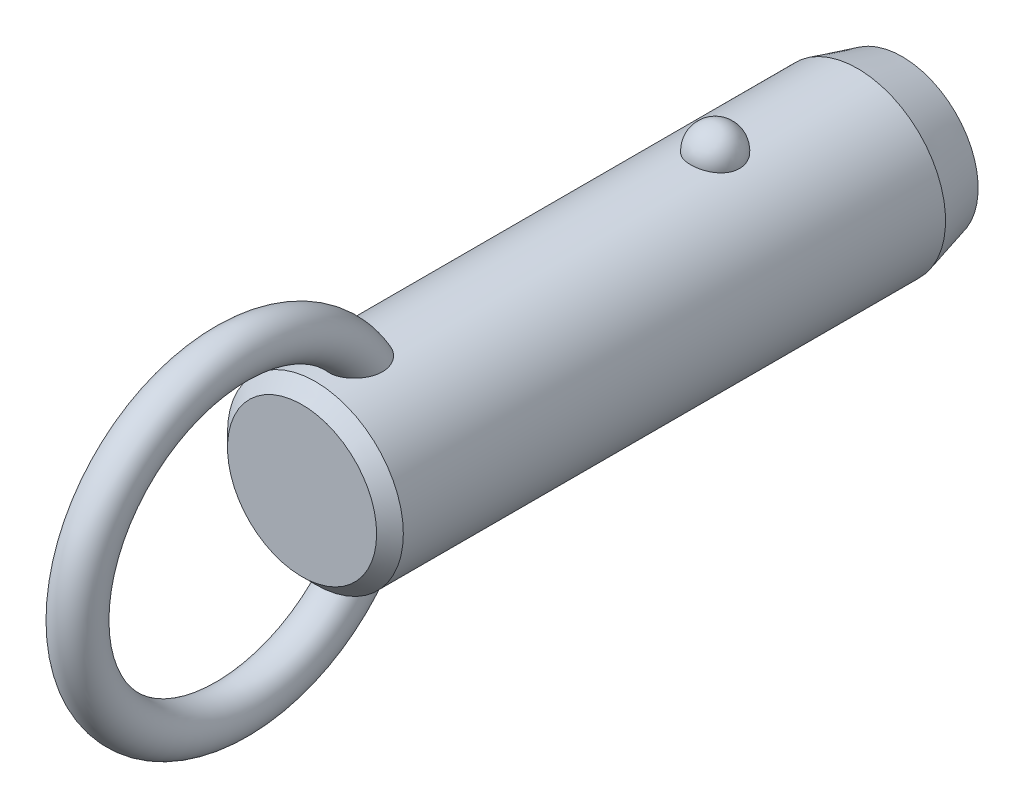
ISO-10303-21;
HEADER;
FILE_DESCRIPTION(('STEP AP214'),'2;1');
FILE_NAME('part.step','',(''),(''),'','','');
FILE_SCHEMA(('AUTOMOTIVE_DESIGN { 1 0 10303 214 1 1 1 1 }'));
ENDSEC;
DATA;
#1=APPLICATION_CONTEXT('core data for automotive mechanical design processes');
#2=APPLICATION_PROTOCOL_DEFINITION('international standard','automotive_design',2000,#1);
#3=PRODUCT_CONTEXT('',#1,'mechanical');
#4=PRODUCT('Part','Part','',(#3));
#5=PRODUCT_RELATED_PRODUCT_CATEGORY('part','',(#4));
#6=PRODUCT_DEFINITION_FORMATION('','',#4);
#7=PRODUCT_DEFINITION_CONTEXT('part definition',#1,'design');
#8=PRODUCT_DEFINITION('design','',#6,#7);
#9=PRODUCT_DEFINITION_SHAPE('','',#8);
#10=(LENGTH_UNIT() NAMED_UNIT(*) SI_UNIT(.MILLI.,.METRE.));
#11=(NAMED_UNIT(*) PLANE_ANGLE_UNIT() SI_UNIT($,.RADIAN.));
#12=(NAMED_UNIT(*) SI_UNIT($,.STERADIAN.) SOLID_ANGLE_UNIT());
#13=UNCERTAINTY_MEASURE_WITH_UNIT(LENGTH_MEASURE(1.E-05),#10,'distance_accuracy_value','');
#14=(GEOMETRIC_REPRESENTATION_CONTEXT(3) GLOBAL_UNCERTAINTY_ASSIGNED_CONTEXT((#13)) GLOBAL_UNIT_ASSIGNED_CONTEXT((#10,
#11,#12)) REPRESENTATION_CONTEXT('',''));
#15=CARTESIAN_POINT('',(0.,0.,0.));
#16=DIRECTION('',(0.,0.,1.));
#17=DIRECTION('',(1.,0.,0.));
#18=AXIS2_PLACEMENT_3D('',#15,#16,#17);
#19=CARTESIAN_POINT('',(0.,0.,25.4));
#20=DIRECTION('',(0.,0.,-1.));
#21=DIRECTION('',(-1.,0.,0.));
#22=AXIS2_PLACEMENT_3D('',#19,#20,#21);
#23=CYLINDRICAL_SURFACE('',#22,7.9);
#24=CARTESIAN_POINT('',(2.1785689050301,7.59367088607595,-2.20000000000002));
#25=CARTESIAN_POINT('',(2.17856679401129,7.59367269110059,-2.07701843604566));
#26=CARTESIAN_POINT('',(2.16853481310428,7.59657145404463,-1.95401006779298));
#27=CARTESIAN_POINT('',(2.12864689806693,7.607843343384,-1.71147811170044));
#28=CARTESIAN_POINT('',(2.09878338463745,7.61621856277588,-1.5919558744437));
#29=CARTESIAN_POINT('',(2.0199931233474,7.63749180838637,-1.35985638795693));
#30=CARTESIAN_POINT('',(1.97107475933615,7.6503878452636,-1.24727610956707));
#31=CARTESIAN_POINT('',(1.85539377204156,7.67926115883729,-1.03213234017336));
#32=CARTESIAN_POINT('',(1.78863158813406,7.69523835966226,-0.929568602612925));
#33=CARTESIAN_POINT('',(1.63856494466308,7.7285848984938,-0.73678633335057));
#34=CARTESIAN_POINT('',(1.55518140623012,7.7459606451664,-0.646630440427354));
#35=CARTESIAN_POINT('',(1.37422937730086,7.78009978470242,-0.481747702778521));
#36=CARTESIAN_POINT('',(1.27666086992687,7.79686317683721,-0.407020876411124));
#37=CARTESIAN_POINT('',(1.07024728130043,7.82786153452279,-0.275278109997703));
#38=CARTESIAN_POINT('',(0.961434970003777,7.84210353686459,-0.218212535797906));
#39=CARTESIAN_POINT('',(0.735351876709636,7.86652194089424,-0.123146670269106));
#40=CARTESIAN_POINT('',(0.618082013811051,7.87669878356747,-0.0851443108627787));
#41=CARTESIAN_POINT('',(0.380637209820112,7.89170521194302,-0.0298158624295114));
#42=CARTESIAN_POINT('',(0.260550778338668,7.89662650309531,-0.0121347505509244));
#43=CARTESIAN_POINT('',(0.0190117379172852,7.90090003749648,0.00324379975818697));
#44=CARTESIAN_POINT('',(-0.102440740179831,7.90025280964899,0.000943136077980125));
#45=CARTESIAN_POINT('',(-0.341452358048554,7.89351056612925,-0.0233955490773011));
#46=CARTESIAN_POINT('',(-0.459042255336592,7.88749257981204,-0.0451545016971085));
#47=CARTESIAN_POINT('',(-0.688796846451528,7.87075812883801,-0.107408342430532));
#48=CARTESIAN_POINT('',(-0.800961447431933,7.86004158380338,-0.14790355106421));
#49=CARTESIAN_POINT('',(-1.01743634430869,7.83497131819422,-0.246799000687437));
#50=CARTESIAN_POINT('',(-1.12169791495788,7.82059709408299,-0.305300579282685));
#51=CARTESIAN_POINT('',(-1.31891765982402,7.78976470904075,-0.43854939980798));
#52=CARTESIAN_POINT('',(-1.41187469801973,7.77330633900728,-0.513298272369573));
#53=CARTESIAN_POINT('',(-1.58577142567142,7.73972434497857,-0.678622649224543));
#54=CARTESIAN_POINT('',(-1.66645140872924,7.72259402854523,-0.769470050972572));
#55=CARTESIAN_POINT('',(-1.81161503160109,7.68983776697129,-0.963538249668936));
#56=CARTESIAN_POINT('',(-1.87609753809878,7.6742119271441,-1.0667599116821));
#57=CARTESIAN_POINT('',(-1.98790138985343,7.6460202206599,-1.28401170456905));
#58=CARTESIAN_POINT('',(-2.03501994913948,7.63349104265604,-1.39815107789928));
#59=CARTESIAN_POINT('',(-2.10986724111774,7.6131449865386,-1.6330178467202));
#60=CARTESIAN_POINT('',(-2.1375965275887,7.60532797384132,-1.75374505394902));
#61=CARTESIAN_POINT('',(-2.17289256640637,7.5953195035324,-1.99782562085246));
#62=CARTESIAN_POINT('',(-2.18054294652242,7.59310471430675,-2.12116592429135));
#63=CARTESIAN_POINT('',(-2.17572919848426,7.59448538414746,-2.36741799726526));
#64=CARTESIAN_POINT('',(-2.1632656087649,7.59808068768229,-2.49032977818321));
#65=CARTESIAN_POINT('',(-2.11865035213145,7.61064035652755,-2.73161015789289));
#66=CARTESIAN_POINT('',(-2.08659579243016,7.61957823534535,-2.84999812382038));
#67=CARTESIAN_POINT('',(-2.00367799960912,7.64179982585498,-3.07955956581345));
#68=CARTESIAN_POINT('',(-1.9528140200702,7.65508371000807,-3.19073275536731));
#69=CARTESIAN_POINT('',(-1.83321113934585,7.68460381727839,-3.40337899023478));
#70=CARTESIAN_POINT('',(-1.76437735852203,7.70085556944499,-3.5047965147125));
#71=CARTESIAN_POINT('',(-1.61069526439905,7.73445734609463,-3.69446912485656));
#72=CARTESIAN_POINT('',(-1.52584634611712,7.75180741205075,-3.78272371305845));
#73=CARTESIAN_POINT('',(-1.34198059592,7.78574608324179,-3.94393987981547));
#74=CARTESIAN_POINT('',(-1.24291308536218,7.80233167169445,-4.01684434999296));
#75=CARTESIAN_POINT('',(-1.03352039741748,7.83281625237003,-4.14489386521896));
#76=CARTESIAN_POINT('',(-0.92319600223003,7.84671543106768,-4.20004014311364));
#77=CARTESIAN_POINT('',(-0.695822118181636,7.87011575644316,-4.29042017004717));
#78=CARTESIAN_POINT('',(-0.578872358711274,7.87966903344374,-4.32589112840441));
#79=CARTESIAN_POINT('',(-0.340410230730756,7.8935652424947,-4.37692226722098));
#80=CARTESIAN_POINT('',(-0.218898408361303,7.89790879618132,-4.39248482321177));
#81=CARTESIAN_POINT('',(0.0228107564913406,7.90087453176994,-4.40314405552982));
#82=CARTESIAN_POINT('',(0.142990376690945,7.89960185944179,-4.39861683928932));
#83=CARTESIAN_POINT('',(0.380829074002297,7.89171262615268,-4.37008293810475));
#84=CARTESIAN_POINT('',(0.498488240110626,7.8850962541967,-4.34607694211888));
#85=CARTESIAN_POINT('',(0.727535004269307,7.86726442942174,-4.27939317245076));
#86=CARTESIAN_POINT('',(0.838944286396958,7.85606616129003,-4.23678512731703));
#87=CARTESIAN_POINT('',(1.05295421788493,7.83025654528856,-4.13408348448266));
#88=CARTESIAN_POINT('',(1.15555431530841,7.81564498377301,-4.07398879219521));
#89=CARTESIAN_POINT('',(1.35076763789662,7.7843022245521,-3.93687432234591));
#90=CARTESIAN_POINT('',(1.4432046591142,7.76754209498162,-3.85961036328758));
#91=CARTESIAN_POINT('',(1.6139111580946,7.73387857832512,-3.69076949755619));
#92=CARTESIAN_POINT('',(1.6921781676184,7.71697516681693,-3.59919010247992));
#93=CARTESIAN_POINT('',(1.83380875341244,7.6845643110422,-3.40247278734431));
#94=CARTESIAN_POINT('',(1.89689280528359,7.66908588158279,-3.29712873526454));
#95=CARTESIAN_POINT('',(2.0047823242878,7.64159441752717,-3.07707931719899));
#96=CARTESIAN_POINT('',(2.0495945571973,7.62958010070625,-2.96237743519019));
#97=CARTESIAN_POINT('',(2.11580183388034,7.61146617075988,-2.74040519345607));
#98=CARTESIAN_POINT('',(2.13929812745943,7.60484503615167,-2.63379846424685));
#99=CARTESIAN_POINT('',(2.17068242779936,7.59594664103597,-2.4181348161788));
#100=CARTESIAN_POINT('',(2.17857077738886,7.59366928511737,-2.30907795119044));
#101=CARTESIAN_POINT('',(2.1785689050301,7.59367088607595,-2.20000000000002));
#102=B_SPLINE_CURVE_WITH_KNOTS('',3,(#24,#25,#26,#27,#28,#29,#30,#31,#32,#33,#34,#35,#36,#37,
#38,#39,#40,#41,#42,#43,#44,#45,#46,#47,#48,#49,#50,#51,#52,#53,#54,#55,#56,#57,#58,#59,#60,#61,
#62,#63,#64,#65,#66,#67,#68,#69,#70,#71,#72,#73,#74,#75,#76,#77,#78,#79,#80,#81,#82,#83,#84,#85,
#86,#87,#88,#89,#90,#91,#92,#93,#94,#95,#96,#97,#98,#99,#100,#101),.UNSPECIFIED.,.T.,.F.,(4,2,2,
2,2,2,2,2,2,2,2,2,2,2,2,2,2,2,2,2,2,2,2,2,2,2,2,2,2,2,2,2,2,2,2,2,2,2,4),(0.,0.368552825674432,
0.737246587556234,1.10577831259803,1.4743009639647,1.8446206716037,2.21494081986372,
2.5842105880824,2.95344028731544,3.31611630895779,3.67875788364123,4.03628044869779,
4.39380913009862,4.75338791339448,5.11300280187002,5.47939989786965,5.8458226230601,
6.21639834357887,6.58696347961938,6.95598276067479,7.32499216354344,7.69218715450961,
8.0593967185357,8.42858578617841,8.79778880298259,9.16834203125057,9.5388695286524,
9.90482699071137,10.2707407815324,10.6298333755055,10.9889132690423,11.3466585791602,
11.7044262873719,12.0676511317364,12.4309391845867,12.8004764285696,13.1698767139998,
13.4967701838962,13.8236564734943),.UNSPECIFIED.);
#103=CARTESIAN_POINT('',(2.1785689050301,7.59367088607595,-2.20000000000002));
#104=VERTEX_POINT('',#103);
#105=EDGE_CURVE('E41',#104,#104,#102,.T.);
#106=ORIENTED_EDGE('',*,*,#105,.T.);
#107=EDGE_LOOP('',(#106));
#108=FACE_BOUND('',#107,.T.);
#109=CARTESIAN_POINT('',(0.,0.,33.72));
#110=DIRECTION('',(0.,0.,1.));
#111=DIRECTION('',(1.,0.,0.));
#112=AXIS2_PLACEMENT_3D('',#109,#110,#111);
#113=CIRCLE('',#112,7.9);
#114=CARTESIAN_POINT('',(7.9,0.,33.72));
#115=VERTEX_POINT('',#114);
#116=EDGE_CURVE('E10',#115,#115,#113,.F.);
#117=ORIENTED_EDGE('',*,*,#116,.T.);
#118=EDGE_LOOP('',(#117));
#119=FACE_BOUND('',#118,.T.);
#120=CARTESIAN_POINT('',(-0.630969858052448,-7.87476203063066,27.6124322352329));
#121=CARTESIAN_POINT('',(-0.734180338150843,-7.8664899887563,27.6472854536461));
#122=CARTESIAN_POINT('',(-0.834476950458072,-7.85639291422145,27.6908160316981));
#123=CARTESIAN_POINT('',(-1.0262035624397,-7.83366343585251,27.7940948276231));
#124=CARTESIAN_POINT('',(-1.1176141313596,-7.82102565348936,27.8538775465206));
#125=CARTESIAN_POINT('',(-1.28877277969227,-7.79464922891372,27.9878390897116));
#126=CARTESIAN_POINT('',(-1.36854014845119,-7.78091246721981,28.061993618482));
#127=CARTESIAN_POINT('',(-1.51461521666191,-7.75380398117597,28.2224941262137));
#128=CARTESIAN_POINT('',(-1.58092966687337,-7.74043207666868,28.3088339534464));
#129=CARTESIAN_POINT('',(-1.70019064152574,-7.71512522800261,28.4929784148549));
#130=CARTESIAN_POINT('',(-1.75284037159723,-7.70322473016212,28.5909792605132));
#131=CARTESIAN_POINT('',(-1.84263464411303,-7.68224112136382,28.7941029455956));
#132=CARTESIAN_POINT('',(-1.87977299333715,-7.6731591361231,28.8992286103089));
#133=CARTESIAN_POINT('',(-1.94152728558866,-7.65777930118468,29.1232849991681));
#134=CARTESIAN_POINT('',(-1.96475471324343,-7.65179654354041,29.2426167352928));
#135=CARTESIAN_POINT('',(-1.99449499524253,-7.64409642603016,29.4834298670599));
#136=CARTESIAN_POINT('',(-2.0010005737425,-7.64238092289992,29.6049121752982));
#137=CARTESIAN_POINT('',(-1.99856014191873,-7.64302120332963,29.8683409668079));
#138=CARTESIAN_POINT('',(-1.98680021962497,-7.64611845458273,30.0102565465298));
#139=CARTESIAN_POINT('',(-1.94457772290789,-7.65696186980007,30.2911188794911));
#140=CARTESIAN_POINT('',(-1.91409393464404,-7.66471330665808,30.4300620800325));
#141=CARTESIAN_POINT('',(-1.82768670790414,-7.68582947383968,30.7319397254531));
#142=CARTESIAN_POINT('',(-1.76772963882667,-7.70003779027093,30.893686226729));
#143=CARTESIAN_POINT('',(-1.65998501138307,-7.72371550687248,31.1276956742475));
#144=CARTESIAN_POINT('',(-1.62107967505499,-7.73200670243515,31.2042974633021));
#145=CARTESIAN_POINT('',(-1.53727726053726,-7.7491037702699,31.3540798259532));
#146=CARTESIAN_POINT('',(-1.4923821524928,-7.75790947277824,31.4272615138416));
#147=CARTESIAN_POINT('',(-1.37397050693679,-7.77993338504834,31.6028838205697));
#148=CARTESIAN_POINT('',(-1.29690364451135,-7.79328473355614,31.7029557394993));
#149=CARTESIAN_POINT('',(-1.12885487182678,-7.81939266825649,31.8907147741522));
#150=CARTESIAN_POINT('',(-1.03789926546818,-7.83215032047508,31.9784247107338));
#151=CARTESIAN_POINT('',(-0.869532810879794,-7.85231710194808,32.1134148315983));
#152=CARTESIAN_POINT('',(-0.795716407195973,-7.86021093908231,32.165076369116));
#153=CARTESIAN_POINT('',(-0.640813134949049,-7.87434920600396,32.2563815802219));
#154=CARTESIAN_POINT('',(-0.55973779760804,-7.88059619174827,32.2960438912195));
#155=CARTESIAN_POINT('',(-0.40645605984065,-7.88984116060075,32.3543008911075));
#156=CARTESIAN_POINT('',(-0.335227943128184,-7.89321892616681,32.3753848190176));
#157=CARTESIAN_POINT('',(-0.190193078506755,-7.89804235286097,32.4054141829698));
#158=CARTESIAN_POINT('',(-0.116388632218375,-7.89948969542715,32.4143701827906));
#159=CARTESIAN_POINT('',(0.0318414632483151,-7.90028409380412,32.4192915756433));
#160=CARTESIAN_POINT('',(0.106268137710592,-7.89962640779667,32.4152276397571));
#161=CARTESIAN_POINT('',(0.253290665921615,-7.8962818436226,32.3944615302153));
#162=CARTESIAN_POINT('',(0.325885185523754,-7.8935935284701,32.3777504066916));
#163=CARTESIAN_POINT('',(0.481441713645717,-7.88577340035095,32.3287380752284));
#164=CARTESIAN_POINT('',(0.563611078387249,-7.88026321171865,32.294005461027));
#165=CARTESIAN_POINT('',(0.721129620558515,-7.86741729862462,32.2117965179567));
#166=CARTESIAN_POINT('',(0.79646633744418,-7.86007832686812,32.1642975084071));
#167=CARTESIAN_POINT('',(0.971456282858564,-7.84073285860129,32.036513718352));
#168=CARTESIAN_POINT('',(1.0671968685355,-7.82809461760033,31.9510047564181));
#169=CARTESIAN_POINT('',(1.24418921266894,-7.80192439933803,31.766232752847));
#170=CARTESIAN_POINT('',(1.32540832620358,-7.78839049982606,31.6669395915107));
#171=CARTESIAN_POINT('',(1.45199971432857,-7.76559693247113,31.4895760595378));
#172=CARTESIAN_POINT('',(1.5008564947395,-7.75626094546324,31.4139542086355));
#173=CARTESIAN_POINT('',(1.59197749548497,-7.7380727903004,31.2587428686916));
#174=CARTESIAN_POINT('',(1.63423919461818,-7.72922080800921,31.1791518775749));
#175=CARTESIAN_POINT('',(1.71222612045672,-7.71231959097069,31.0166640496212));
#176=CARTESIAN_POINT('',(1.7479451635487,-7.70427111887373,30.933764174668));
#177=CARTESIAN_POINT('',(1.81270113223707,-7.68929240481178,30.7652967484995));
#178=CARTESIAN_POINT('',(1.84173789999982,-7.68236218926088,30.6797291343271));
#179=CARTESIAN_POINT('',(1.89322698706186,-7.6698375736,30.5052870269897));
#180=CARTESIAN_POINT('',(1.91558744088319,-7.66426199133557,30.4163838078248));
#181=CARTESIAN_POINT('',(1.95281367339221,-7.65485915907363,30.2369696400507));
#182=CARTESIAN_POINT('',(1.96767946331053,-7.65103190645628,30.1464586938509));
#183=CARTESIAN_POINT('',(2.00021456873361,-7.64262981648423,29.8737320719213));
#184=CARTESIAN_POINT('',(2.00600691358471,-7.6410871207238,29.6897099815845));
#185=CARTESIAN_POINT('',(1.98445334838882,-7.64669564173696,29.3765019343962));
#186=CARTESIAN_POINT('',(1.96607186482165,-7.65149688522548,29.246618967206));
#187=CARTESIAN_POINT('',(1.90884967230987,-7.6659762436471,28.9916321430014));
#188=CARTESIAN_POINT('',(1.87002101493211,-7.67565148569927,28.866525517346));
#189=CARTESIAN_POINT('',(1.77063986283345,-7.69918471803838,28.6245401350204));
#190=CARTESIAN_POINT('',(1.7099372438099,-7.71307150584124,28.5077250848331));
#191=CARTESIAN_POINT('',(1.56733070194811,-7.74330306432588,28.2881444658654));
#192=CARTESIAN_POINT('',(1.4854369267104,-7.75964665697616,28.1853722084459));
#193=CARTESIAN_POINT('',(1.31346177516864,-7.79047523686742,28.0093800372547));
#194=CARTESIAN_POINT('',(1.22547278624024,-7.80495298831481,27.9341066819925));
#195=CARTESIAN_POINT('',(1.03724352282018,-7.83218597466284,27.8004864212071));
#196=CARTESIAN_POINT('',(0.937008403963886,-7.84494192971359,27.7421324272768));
#197=CARTESIAN_POINT('',(0.733599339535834,-7.86649045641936,27.6470270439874));
#198=CARTESIAN_POINT('',(0.630941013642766,-7.87547134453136,27.6092109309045));
#199=CARTESIAN_POINT('',(0.420465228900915,-7.88950708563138,27.5511160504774));
#200=CARTESIAN_POINT('',(0.312645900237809,-7.89456050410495,27.5308436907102));
#201=CARTESIAN_POINT('',(0.0960869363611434,-7.9001518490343,27.5084559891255));
#202=CARTESIAN_POINT('',(-0.0126341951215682,-7.90073226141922,27.5061698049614));
#203=CARTESIAN_POINT('',(-0.228766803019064,-7.89742350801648,27.5193678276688));
#204=CARTESIAN_POINT('',(-0.336180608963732,-7.89354403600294,27.5348134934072));
#205=CARTESIAN_POINT('',(-0.473410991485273,-7.88586871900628,27.5662177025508));
#206=CARTESIAN_POINT('',(-0.505257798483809,-7.88388984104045,27.5743541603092));
#207=CARTESIAN_POINT('',(-0.568481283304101,-7.87958326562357,27.5922083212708));
#208=CARTESIAN_POINT('',(-0.599857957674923,-7.87725556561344,27.6019260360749));
#209=CARTESIAN_POINT('',(-0.630969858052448,-7.87476203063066,27.6124322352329));
#210=B_SPLINE_CURVE_WITH_KNOTS('',3,(#120,#121,#122,#123,#124,#125,#126,#127,#128,#129,#130,
#131,#132,#133,#134,#135,#136,#137,#138,#139,#140,#141,#142,#143,#144,#145,#146,#147,#148,#149,
#150,#151,#152,#153,#154,#155,#156,#157,#158,#159,#160,#161,#162,#163,#164,#165,#166,#167,#168,
#169,#170,#171,#172,#173,#174,#175,#176,#177,#178,#179,#180,#181,#182,#183,#184,#185,#186,#187,
#188,#189,#190,#191,#192,#193,#194,#195,#196,#197,#198,#199,#200,#201,#202,#203,#204,#205,#206,
#207,#208,#209),.UNSPECIFIED.,.T.,.F.,(4,2,2,2,2,2,2,2,2,2,2,2,2,2,2,2,2,2,2,2,2,2,2,2,2,2,2,2,
2,2,2,2,2,2,2,2,2,2,2,2,2,2,2,2,4),(0.,0.327622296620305,0.655945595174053,0.98371863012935,
1.3113267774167,1.64554655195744,1.97989964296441,2.34365728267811,2.70757317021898,
3.13333684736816,3.55958380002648,4.07655306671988,4.33527897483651,4.593919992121,
4.97382437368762,5.35301797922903,5.62348245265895,5.89352465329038,6.11565959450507,
6.33760092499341,6.56004255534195,6.782641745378,7.04930844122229,7.31645206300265,
7.70130871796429,8.08701995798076,8.35824509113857,8.62957365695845,8.90115735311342,
9.17274746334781,9.44791855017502,9.72308922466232,10.2715298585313,10.6638393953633,
11.0559179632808,11.4507403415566,11.845374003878,12.1936425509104,12.5417649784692,
12.8695063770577,13.1973674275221,13.5221104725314,13.8461490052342,13.9449071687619,
14.0436660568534),.UNSPECIFIED.);
#211=CARTESIAN_POINT('',(-0.630969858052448,-7.87476203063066,27.6124322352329));
#212=VERTEX_POINT('',#211);
#213=EDGE_CURVE('E60',#212,#212,#210,.T.);
#214=ORIENTED_EDGE('',*,*,#213,.T.);
#215=EDGE_LOOP('',(#214));
#216=FACE_BOUND('',#215,.T.);
#217=CARTESIAN_POINT('',(-0.630969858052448,7.87476203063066,27.6124322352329));
#218=CARTESIAN_POINT('',(-0.528918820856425,7.88293636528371,27.5779798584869));
#219=CARTESIAN_POINT('',(-0.423745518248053,7.88934810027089,27.551915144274));
#220=CARTESIAN_POINT('',(-0.210236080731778,7.8979273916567,27.5172825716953));
#221=CARTESIAN_POINT('',(-0.101893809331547,7.90008607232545,27.5087513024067));
#222=CARTESIAN_POINT('',(0.114660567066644,7.89990877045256,27.5094570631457));
#223=CARTESIAN_POINT('',(0.222872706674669,7.89757640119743,27.5186798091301));
#224=CARTESIAN_POINT('',(0.436107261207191,7.88867538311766,27.5546525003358));
#225=CARTESIAN_POINT('',(0.541131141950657,7.8821087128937,27.5813942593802));
#226=CARTESIAN_POINT('',(0.745085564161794,7.86545130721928,27.6517561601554));
#227=CARTESIAN_POINT('',(0.844015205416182,7.85536005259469,27.6953787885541));
#228=CARTESIAN_POINT('',(1.03299167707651,7.83275153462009,27.7983796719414));
#229=CARTESIAN_POINT('',(1.12303841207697,7.8202342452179,27.8577580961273));
#230=CARTESIAN_POINT('',(1.29214734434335,7.79408219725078,27.9908647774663));
#231=CARTESIAN_POINT('',(1.37116907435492,7.78044359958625,28.0646436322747));
#232=CARTESIAN_POINT('',(1.51597677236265,7.75353170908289,28.2242353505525));
#233=CARTESIAN_POINT('',(1.58176261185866,7.74025841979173,28.3100483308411));
#234=CARTESIAN_POINT('',(1.70057386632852,7.71504069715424,28.493644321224));
#235=CARTESIAN_POINT('',(1.75320073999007,7.7031425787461,28.5916906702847));
#236=CARTESIAN_POINT('',(1.84293767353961,7.68216822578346,28.7948931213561));
#237=CARTESIAN_POINT('',(1.88004278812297,7.67309289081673,28.9000514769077));
#238=CARTESIAN_POINT('',(1.9417232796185,7.6577294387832,29.1241671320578));
#239=CARTESIAN_POINT('',(1.96491037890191,7.65175648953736,29.2435248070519));
#240=CARTESIAN_POINT('',(1.9945689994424,7.64407702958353,29.4843848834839));
#241=CARTESIAN_POINT('',(2.00103304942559,7.64237242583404,29.6058882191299));
#242=CARTESIAN_POINT('',(1.9985016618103,7.64303650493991,29.8693688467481));
#243=CARTESIAN_POINT('',(1.98669038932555,7.64614714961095,30.0113141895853));
#244=CARTESIAN_POINT('',(1.94436120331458,7.6570170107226,30.2922287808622));
#245=CARTESIAN_POINT('',(1.91382203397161,7.66478150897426,30.4311944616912));
#246=CARTESIAN_POINT('',(1.82728754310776,7.68592483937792,30.7331110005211));
#247=CARTESIAN_POINT('',(1.76725778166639,7.7001468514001,30.894872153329));
#248=CARTESIAN_POINT('',(1.65939700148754,7.72384204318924,31.1288914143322));
#249=CARTESIAN_POINT('',(1.62045187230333,7.73213852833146,31.2054942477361));
#250=CARTESIAN_POINT('',(1.5365668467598,7.74924489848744,31.3552737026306));
#251=CARTESIAN_POINT('',(1.49162892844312,7.75805461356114,31.4284514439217));
#252=CARTESIAN_POINT('',(1.37317698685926,7.78007342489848,31.6039520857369));
#253=CARTESIAN_POINT('',(1.29612360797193,7.79341423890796,31.7039112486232));
#254=CARTESIAN_POINT('',(1.12812043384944,7.81949839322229,31.8914508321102));
#255=CARTESIAN_POINT('',(1.03719688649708,7.83224280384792,31.9790540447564));
#256=CARTESIAN_POINT('',(0.868871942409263,7.85239026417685,32.1138971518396));
#257=CARTESIAN_POINT('',(0.795056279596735,7.86027769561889,32.1655113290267));
#258=CARTESIAN_POINT('',(0.64016072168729,7.87440222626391,32.2567201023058));
#259=CARTESIAN_POINT('',(0.559092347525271,7.88064188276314,32.2963333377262));
#260=CARTESIAN_POINT('',(0.405820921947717,7.8898738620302,32.3545056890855));
#261=CARTESIAN_POINT('',(0.334594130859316,7.89324577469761,32.3755523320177));
#262=CARTESIAN_POINT('',(0.189568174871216,7.89805733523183,32.4055070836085));
#263=CARTESIAN_POINT('',(0.115771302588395,7.89949866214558,32.4144257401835));
#264=CARTESIAN_POINT('',(-0.0324359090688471,7.90028156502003,32.4192758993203));
#265=CARTESIAN_POINT('',(-0.106847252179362,7.89961843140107,32.4151782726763));
#266=CARTESIAN_POINT('',(-0.253834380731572,7.8962642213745,32.3943519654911));
#267=CARTESIAN_POINT('',(-0.326408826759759,7.89357170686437,32.3776143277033));
#268=CARTESIAN_POINT('',(-0.481962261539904,7.88574179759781,32.3285391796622));
#269=CARTESIAN_POINT('',(-0.564145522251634,7.88022507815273,32.2937638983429));
#270=CARTESIAN_POINT('',(-0.721685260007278,7.8673664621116,32.2114686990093));
#271=CARTESIAN_POINT('',(-0.797029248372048,7.8600213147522,32.1639260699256));
#272=CARTESIAN_POINT('',(-0.972044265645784,7.84066026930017,32.0360267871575));
#273=CARTESIAN_POINT('',(-1.06779803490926,7.82801274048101,31.9504436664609));
#274=CARTESIAN_POINT('',(-1.24480531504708,7.80182621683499,31.7655223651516));
#275=CARTESIAN_POINT('',(-1.32602618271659,7.78828530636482,31.6661540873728));
#276=CARTESIAN_POINT('',(-1.45259834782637,7.76548487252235,31.4886806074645));
#277=CARTESIAN_POINT('',(-1.50143856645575,7.75614818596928,31.4130252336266));
#278=CARTESIAN_POINT('',(-1.59252410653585,7.73796020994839,31.2577484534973));
#279=CARTESIAN_POINT('',(-1.63476690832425,7.72910910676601,31.1781255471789));
#280=CARTESIAN_POINT('',(-1.71271318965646,7.71221133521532,31.0155750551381));
#281=CARTESIAN_POINT('',(-1.74841047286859,7.70416543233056,30.9326444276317));
#282=CARTESIAN_POINT('',(-1.81311929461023,7.6891937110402,30.7641168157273));
#283=CARTESIAN_POINT('',(-1.84213067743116,7.6822679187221,30.6785197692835));
#284=CARTESIAN_POINT('',(-1.89356259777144,7.66975461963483,30.5040254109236));
#285=CARTESIAN_POINT('',(-1.91589165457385,7.66418586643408,30.4150995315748));
#286=CARTESIAN_POINT('',(-1.95305070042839,7.65479859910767,30.2356424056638));
#287=CARTESIAN_POINT('',(-1.96788069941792,7.65098008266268,30.1451111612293));
#288=CARTESIAN_POINT('',(-2.00030078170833,7.64260704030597,29.8723270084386));
#289=CARTESIAN_POINT('',(-2.00600576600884,7.64108760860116,29.6882718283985));
#290=CARTESIAN_POINT('',(-1.98428483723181,7.64673945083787,29.3750800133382));
#291=CARTESIAN_POINT('',(-1.96583698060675,7.6515575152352,29.2452400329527));
#292=CARTESIAN_POINT('',(-1.90848948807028,7.66606613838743,28.9903619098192));
#293=CARTESIAN_POINT('',(-1.86960376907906,7.67575338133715,28.865320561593));
#294=CARTESIAN_POINT('',(-1.7701342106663,7.6993013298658,28.6235009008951));
#295=CARTESIAN_POINT('',(-1.70940488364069,7.71318991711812,28.5067844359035));
#296=CARTESIAN_POINT('',(-1.56672953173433,7.74342495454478,28.2873404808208));
#297=CARTESIAN_POINT('',(-1.48478316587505,7.75977144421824,28.1846132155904));
#298=CARTESIAN_POINT('',(-1.31266325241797,7.79061163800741,28.0086431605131));
#299=CARTESIAN_POINT('',(-1.22456383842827,7.80509908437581,27.9333589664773));
#300=CARTESIAN_POINT('',(-1.03622400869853,7.83231881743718,27.7998659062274));
#301=CARTESIAN_POINT('',(-0.936015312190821,7.84505551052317,27.7416137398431));
#302=CARTESIAN_POINT('',(-0.798824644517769,7.85957802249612,27.6775408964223));
#303=CARTESIAN_POINT('',(-0.76578709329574,7.86286821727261,27.6632248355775));
#304=CARTESIAN_POINT('',(-0.698939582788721,7.86909211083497,27.636436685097));
#305=CARTESIAN_POINT('',(-0.66512963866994,7.8720258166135,27.6239645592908));
#306=CARTESIAN_POINT('',(-0.630969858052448,7.87476203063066,27.6124322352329));
#307=B_SPLINE_CURVE_WITH_KNOTS('',3,(#217,#218,#219,#220,#221,#222,#223,#224,#225,#226,#227,
#228,#229,#230,#231,#232,#233,#234,#235,#236,#237,#238,#239,#240,#241,#242,#243,#244,#245,#246,
#247,#248,#249,#250,#251,#252,#253,#254,#255,#256,#257,#258,#259,#260,#261,#262,#263,#264,#265,
#266,#267,#268,#269,#270,#271,#272,#273,#274,#275,#276,#277,#278,#279,#280,#281,#282,#283,#284,
#285,#286,#287,#288,#289,#290,#291,#292,#293,#294,#295,#296,#297,#298,#299,#300,#301,#302,#303,
#304,#305,#306),.UNSPECIFIED.,.T.,.F.,(4,2,2,2,2,2,2,2,2,2,2,2,2,2,2,2,2,2,2,2,2,2,2,2,2,2,2,2,
2,2,2,2,2,2,2,2,2,2,2,2,2,2,2,2,4),(0.,0.323920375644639,0.64851603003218,0.972850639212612,
1.29703380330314,1.62126473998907,1.94549915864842,2.27089401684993,2.5962920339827,
2.93059633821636,3.26500707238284,3.6288164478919,3.99278833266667,4.41865421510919,
4.84500434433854,5.36209210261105,5.62087589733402,5.87957448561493,6.25918598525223,
6.63808782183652,6.90846748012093,7.17842501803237,7.40052350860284,7.62242871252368,
7.84483086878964,8.06739077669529,8.33414615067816,8.60137921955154,8.98641454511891,
9.37230415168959,9.6435867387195,9.91497268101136,10.1866142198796,10.4582620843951,
10.7334745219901,11.0086865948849,11.5572126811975,11.9494246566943,12.3413699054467,
12.7359755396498,13.1305875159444,13.4791770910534,13.82687259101,13.9353013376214,
14.0437279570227),.UNSPECIFIED.);
#308=CARTESIAN_POINT('',(-0.630969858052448,7.87476203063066,27.6124322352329));
#309=VERTEX_POINT('',#308);
#310=EDGE_CURVE('E68',#309,#309,#307,.T.);
#311=ORIENTED_EDGE('',*,*,#310,.T.);
#312=EDGE_LOOP('',(#311));
#313=FACE_BOUND('',#312,.T.);
#314=CARTESIAN_POINT('',(0.,0.,-15.));
#315=DIRECTION('',(0.,0.,-1.));
#316=DIRECTION('',(-1.,0.,0.));
#317=AXIS2_PLACEMENT_3D('',#314,#315,#316);
#318=CIRCLE('',#317,7.9);
#319=CARTESIAN_POINT('',(-7.9,0.,-15.));
#320=VERTEX_POINT('',#319);
#321=EDGE_CURVE('E57',#320,#320,#318,.F.);
#322=ORIENTED_EDGE('',*,*,#321,.T.);
#323=EDGE_LOOP('',(#322));
#324=FACE_BOUND('',#323,.T.);
#325=ADVANCED_FACE('F37',(#108,#119,#216,#313,#324),#23,.T.);
#326=CARTESIAN_POINT('',(0.,0.,-19.));
#327=DIRECTION('',(0.,0.,-1.));
#328=DIRECTION('',(-1.,0.,0.));
#329=AXIS2_PLACEMENT_3D('',#326,#327,#328);
#330=PLANE('',#329);
#331=CARTESIAN_POINT('',(0.,0.,-19.));
#332=DIRECTION('',(0.,0.,-1.));
#333=DIRECTION('',(-1.,0.,0.));
#334=AXIS2_PLACEMENT_3D('',#331,#332,#333);
#335=CIRCLE('',#334,6.82820323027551);
#336=CARTESIAN_POINT('',(-6.82820323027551,0.,-19.));
#337=VERTEX_POINT('',#336);
#338=EDGE_CURVE('E67',#337,#337,#335,.T.);
#339=ORIENTED_EDGE('',*,*,#338,.T.);
#340=EDGE_LOOP('',(#339));
#341=FACE_BOUND('',#340,.T.);
#342=ADVANCED_FACE('F86',(#341),#330,.T.);
#343=CARTESIAN_POINT('',(0.,0.,-19.));
#344=DIRECTION('',(0.,0.,1.));
#345=DIRECTION('',(1.,0.,0.));
#346=AXIS2_PLACEMENT_3D('',#343,#344,#345);
#347=CONICAL_SURFACE('',#346,6.82820323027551,0.261799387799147);
#348=ORIENTED_EDGE('',*,*,#321,.F.);
#349=EDGE_LOOP('',(#348));
#350=FACE_BOUND('',#349,.T.);
#351=ORIENTED_EDGE('',*,*,#338,.F.);
#352=EDGE_LOOP('',(#351));
#353=FACE_BOUND('',#352,.T.);
#354=ADVANCED_FACE('F84',(#350,#353),#347,.T.);
#355=CARTESIAN_POINT('',(0.,0.,34.92));
#356=DIRECTION('',(0.,0.,1.));
#357=DIRECTION('',(1.,0.,0.));
#358=AXIS2_PLACEMENT_3D('',#355,#356,#357);
#359=PLANE('',#358);
#360=CARTESIAN_POINT('',(0.,0.,34.92));
#361=DIRECTION('',(0.,0.,1.));
#362=DIRECTION('',(1.,0.,0.));
#363=AXIS2_PLACEMENT_3D('',#360,#361,#362);
#364=CIRCLE('',#363,6.7);
#365=CARTESIAN_POINT('',(6.7,0.,34.92));
#366=VERTEX_POINT('',#365);
#367=EDGE_CURVE('E50',#366,#366,#364,.T.);
#368=ORIENTED_EDGE('',*,*,#367,.T.);
#369=EDGE_LOOP('',(#368));
#370=FACE_BOUND('',#369,.T.);
#371=ADVANCED_FACE('F78',(#370),#359,.T.);
#372=CARTESIAN_POINT('',(0.,0.,41.25));
#373=DIRECTION('',(1.,0.,0.));
#374=DIRECTION('',(0.,0.,-1.));
#375=AXIS2_PLACEMENT_3D('',#372,#373,#374);
#376=TOROIDAL_SURFACE('',#375,13.85,2.);
#377=ORIENTED_EDGE('',*,*,#310,.F.);
#378=EDGE_LOOP('',(#377));
#379=FACE_BOUND('',#378,.T.);
#380=ORIENTED_EDGE('',*,*,#213,.F.);
#381=EDGE_LOOP('',(#380));
#382=FACE_BOUND('',#381,.T.);
#383=ADVANCED_FACE('F74',(#379,#382),#376,.T.);
#384=CARTESIAN_POINT('',(0.,0.,34.92));
#385=DIRECTION('',(0.,0.,-1.));
#386=DIRECTION('',(-1.,0.,0.));
#387=AXIS2_PLACEMENT_3D('',#384,#385,#386);
#388=CONICAL_SURFACE('',#387,6.7,0.78539816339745);
#389=ORIENTED_EDGE('',*,*,#116,.F.);
#390=EDGE_LOOP('',(#389));
#391=FACE_BOUND('',#390,.T.);
#392=ORIENTED_EDGE('',*,*,#367,.F.);
#393=EDGE_LOOP('',(#392));
#394=FACE_BOUND('',#393,.T.);
#395=ADVANCED_FACE('F39',(#391,#394),#388,.T.);
#396=CARTESIAN_POINT('',(0.,7.9,-2.20000000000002));
#397=DIRECTION('',(0.,1.,0.));
#398=DIRECTION('',(0.,0.,1.));
#399=AXIS2_PLACEMENT_3D('',#396,#397,#398);
#400=SPHERICAL_SURFACE('',#399,2.2);
#401=ORIENTED_EDGE('',*,*,#105,.F.);
#402=EDGE_LOOP('',(#401));
#403=FACE_BOUND('',#402,.T.);
#404=ADVANCED_FACE('F80',(#403),#400,.T.);
#405=CLOSED_SHELL('',(#325,#342,#354,#371,#383,#395,#404));
#406=MANIFOLD_SOLID_BREP('B2',#405);
#407=ADVANCED_BREP_SHAPE_REPRESENTATION('',(#18,#406),#14);
#408=SHAPE_DEFINITION_REPRESENTATION(#9,#407);
ENDSEC;
END-ISO-10303-21;
